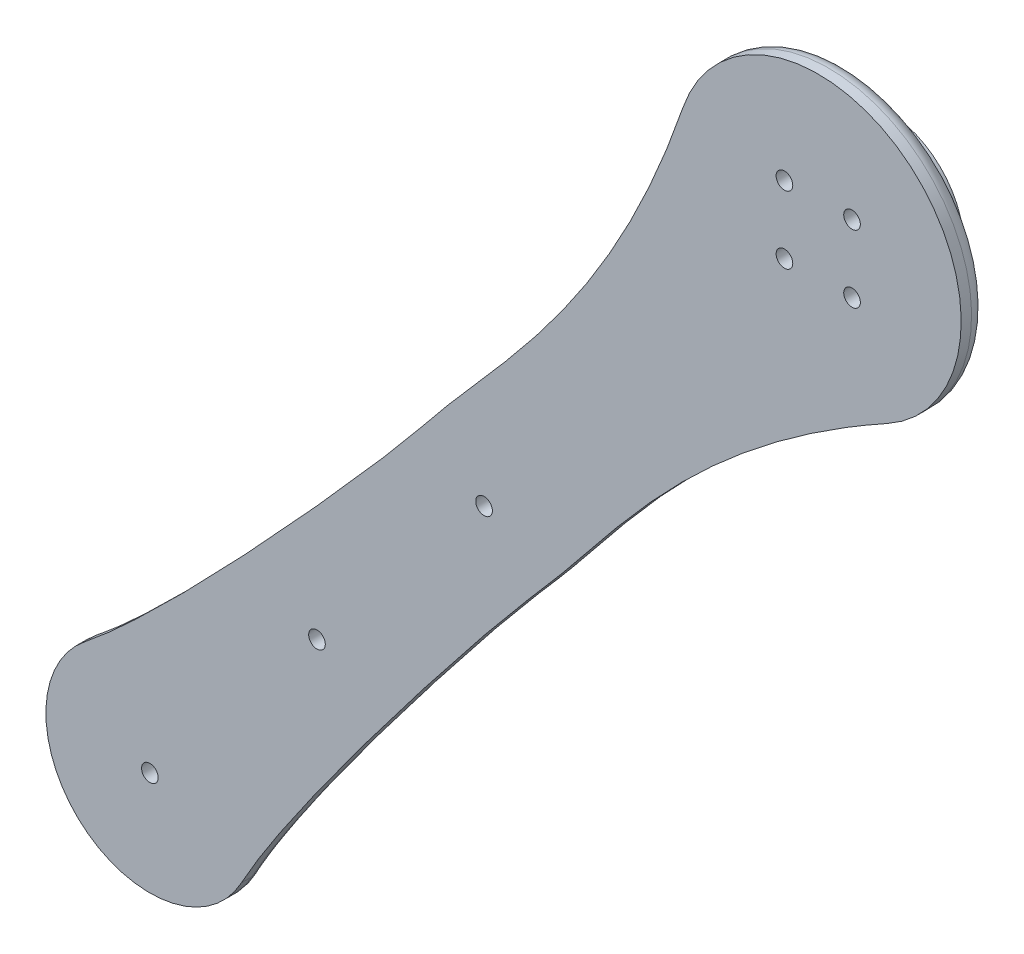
ISO-10303-21;
HEADER;
FILE_DESCRIPTION(('STEP AP214'),'2;1');
FILE_NAME('part.step','',(''),(''),'','','');
FILE_SCHEMA(('AUTOMOTIVE_DESIGN { 1 0 10303 214 1 1 1 1 }'));
ENDSEC;
DATA;
#1=APPLICATION_CONTEXT('core data for automotive mechanical design processes');
#2=APPLICATION_PROTOCOL_DEFINITION('international standard','automotive_design',2000,#1);
#3=PRODUCT_CONTEXT('',#1,'mechanical');
#4=PRODUCT('Part','Part','',(#3));
#5=PRODUCT_RELATED_PRODUCT_CATEGORY('part','',(#4));
#6=PRODUCT_DEFINITION_FORMATION('','',#4);
#7=PRODUCT_DEFINITION_CONTEXT('part definition',#1,'design');
#8=PRODUCT_DEFINITION('design','',#6,#7);
#9=PRODUCT_DEFINITION_SHAPE('','',#8);
#10=(LENGTH_UNIT() NAMED_UNIT(*) SI_UNIT(.MILLI.,.METRE.));
#11=(NAMED_UNIT(*) PLANE_ANGLE_UNIT() SI_UNIT($,.RADIAN.));
#12=(NAMED_UNIT(*) SI_UNIT($,.STERADIAN.) SOLID_ANGLE_UNIT());
#13=UNCERTAINTY_MEASURE_WITH_UNIT(LENGTH_MEASURE(1.E-05),#10,'distance_accuracy_value','');
#14=(GEOMETRIC_REPRESENTATION_CONTEXT(3) GLOBAL_UNCERTAINTY_ASSIGNED_CONTEXT((#13)) GLOBAL_UNIT_ASSIGNED_CONTEXT((#10,
#11,#12)) REPRESENTATION_CONTEXT('',''));
#15=CARTESIAN_POINT('',(0.,0.,0.));
#16=DIRECTION('',(0.,0.,1.));
#17=DIRECTION('',(1.,0.,0.));
#18=AXIS2_PLACEMENT_3D('',#15,#16,#17);
#19=CARTESIAN_POINT('',(148.218221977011,-112.41570779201,10.));
#20=DIRECTION('',(0.,0.,1.));
#21=DIRECTION('',(1.,0.,0.));
#22=AXIS2_PLACEMENT_3D('',#19,#20,#21);
#23=CYLINDRICAL_SURFACE('',#22,1.59999999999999);
#24=CARTESIAN_POINT('',(148.218221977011,-112.41570779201,11.));
#25=DIRECTION('',(0.,0.,-1.));
#26=DIRECTION('',(-1.,0.,0.));
#27=AXIS2_PLACEMENT_3D('',#24,#25,#26);
#28=CIRCLE('',#27,1.59999999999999);
#29=CARTESIAN_POINT('',(146.618221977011,-112.41570779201,11.));
#30=VERTEX_POINT('',#29);
#31=EDGE_CURVE('E103',#30,#30,#28,.F.);
#32=ORIENTED_EDGE('',*,*,#31,.T.);
#33=EDGE_LOOP('',(#32));
#34=FACE_BOUND('',#33,.T.);
#35=CARTESIAN_POINT('',(148.218221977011,-112.41570779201,6.));
#36=DIRECTION('',(0.,0.,-1.));
#37=DIRECTION('',(-1.,0.,0.));
#38=AXIS2_PLACEMENT_3D('',#35,#36,#37);
#39=CIRCLE('',#38,1.59999999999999);
#40=CARTESIAN_POINT('',(146.618221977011,-112.41570779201,6.));
#41=VERTEX_POINT('',#40);
#42=EDGE_CURVE('E79',#41,#41,#39,.F.);
#43=ORIENTED_EDGE('',*,*,#42,.F.);
#44=EDGE_LOOP('',(#43));
#45=FACE_BOUND('',#44,.T.);
#46=ADVANCED_FACE('F75',(#34,#45),#23,.F.);
#47=CARTESIAN_POINT('',(135.218221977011,-112.41570779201,10.));
#48=DIRECTION('',(0.,0.,1.));
#49=DIRECTION('',(1.,0.,0.));
#50=AXIS2_PLACEMENT_3D('',#47,#48,#49);
#51=CYLINDRICAL_SURFACE('',#50,1.59999999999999);
#52=CARTESIAN_POINT('',(135.218221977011,-112.41570779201,11.));
#53=DIRECTION('',(0.,0.,-1.));
#54=DIRECTION('',(-1.,0.,0.));
#55=AXIS2_PLACEMENT_3D('',#52,#53,#54);
#56=CIRCLE('',#55,1.59999999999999);
#57=CARTESIAN_POINT('',(133.618221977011,-112.41570779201,11.));
#58=VERTEX_POINT('',#57);
#59=EDGE_CURVE('E100',#58,#58,#56,.F.);
#60=ORIENTED_EDGE('',*,*,#59,.T.);
#61=EDGE_LOOP('',(#60));
#62=FACE_BOUND('',#61,.T.);
#63=CARTESIAN_POINT('',(135.218221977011,-112.41570779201,6.));
#64=DIRECTION('',(0.,0.,-1.));
#65=DIRECTION('',(-1.,0.,0.));
#66=AXIS2_PLACEMENT_3D('',#63,#64,#65);
#67=CIRCLE('',#66,1.59999999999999);
#68=CARTESIAN_POINT('',(133.618221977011,-112.41570779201,6.));
#69=VERTEX_POINT('',#68);
#70=EDGE_CURVE('E114',#69,#69,#67,.F.);
#71=ORIENTED_EDGE('',*,*,#70,.F.);
#72=EDGE_LOOP('',(#71));
#73=FACE_BOUND('',#72,.T.);
#74=ADVANCED_FACE('F142',(#62,#73),#51,.F.);
#75=CARTESIAN_POINT('',(135.218221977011,-125.41570779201,10.));
#76=DIRECTION('',(0.,0.,1.));
#77=DIRECTION('',(1.,0.,0.));
#78=AXIS2_PLACEMENT_3D('',#75,#76,#77);
#79=CYLINDRICAL_SURFACE('',#78,1.59999999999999);
#80=CARTESIAN_POINT('',(135.218221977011,-125.41570779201,11.));
#81=DIRECTION('',(0.,0.,-1.));
#82=DIRECTION('',(-1.,0.,0.));
#83=AXIS2_PLACEMENT_3D('',#80,#81,#82);
#84=CIRCLE('',#83,1.59999999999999);
#85=CARTESIAN_POINT('',(133.618221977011,-125.41570779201,11.));
#86=VERTEX_POINT('',#85);
#87=EDGE_CURVE('E97',#86,#86,#84,.F.);
#88=ORIENTED_EDGE('',*,*,#87,.T.);
#89=EDGE_LOOP('',(#88));
#90=FACE_BOUND('',#89,.T.);
#91=CARTESIAN_POINT('',(135.218221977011,-125.41570779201,6.));
#92=DIRECTION('',(0.,0.,-1.));
#93=DIRECTION('',(-1.,0.,0.));
#94=AXIS2_PLACEMENT_3D('',#91,#92,#93);
#95=CIRCLE('',#94,1.59999999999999);
#96=CARTESIAN_POINT('',(133.618221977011,-125.41570779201,6.));
#97=VERTEX_POINT('',#96);
#98=EDGE_CURVE('E111',#97,#97,#95,.F.);
#99=ORIENTED_EDGE('',*,*,#98,.F.);
#100=EDGE_LOOP('',(#99));
#101=FACE_BOUND('',#100,.T.);
#102=ADVANCED_FACE('F148',(#90,#101),#79,.F.);
#103=CARTESIAN_POINT('',(148.218221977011,-125.41570779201,10.));
#104=DIRECTION('',(0.,0.,1.));
#105=DIRECTION('',(1.,0.,0.));
#106=AXIS2_PLACEMENT_3D('',#103,#104,#105);
#107=CYLINDRICAL_SURFACE('',#106,1.59999999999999);
#108=CARTESIAN_POINT('',(148.218221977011,-125.41570779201,11.));
#109=DIRECTION('',(0.,0.,-1.));
#110=DIRECTION('',(-1.,0.,0.));
#111=AXIS2_PLACEMENT_3D('',#108,#109,#110);
#112=CIRCLE('',#111,1.59999999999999);
#113=CARTESIAN_POINT('',(146.618221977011,-125.41570779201,11.));
#114=VERTEX_POINT('',#113);
#115=EDGE_CURVE('E94',#114,#114,#112,.F.);
#116=ORIENTED_EDGE('',*,*,#115,.T.);
#117=EDGE_LOOP('',(#116));
#118=FACE_BOUND('',#117,.T.);
#119=CARTESIAN_POINT('',(148.218221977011,-125.41570779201,6.));
#120=DIRECTION('',(0.,0.,-1.));
#121=DIRECTION('',(-1.,0.,0.));
#122=AXIS2_PLACEMENT_3D('',#119,#120,#121);
#123=CIRCLE('',#122,1.59999999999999);
#124=CARTESIAN_POINT('',(146.618221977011,-125.41570779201,6.));
#125=VERTEX_POINT('',#124);
#126=EDGE_CURVE('E108',#125,#125,#123,.F.);
#127=ORIENTED_EDGE('',*,*,#126,.F.);
#128=EDGE_LOOP('',(#127));
#129=FACE_BOUND('',#128,.T.);
#130=ADVANCED_FACE('F158',(#118,#129),#107,.F.);
#131=CARTESIAN_POINT('',(141.718221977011,-118.91570779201,10.));
#132=DIRECTION('',(0.,0.,1.));
#133=DIRECTION('',(1.,0.,0.));
#134=AXIS2_PLACEMENT_3D('',#131,#132,#133);
#135=CYLINDRICAL_SURFACE('',#134,16.);
#136=CARTESIAN_POINT('',(141.718221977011,-118.91570779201,10.));
#137=DIRECTION('',(0.,0.,-1.));
#138=DIRECTION('',(-1.,0.,0.));
#139=AXIS2_PLACEMENT_3D('',#136,#137,#138);
#140=CIRCLE('',#139,16.);
#141=CARTESIAN_POINT('',(125.718221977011,-118.91570779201,10.));
#142=VERTEX_POINT('',#141);
#143=EDGE_CURVE('E83',#142,#142,#140,.T.);
#144=ORIENTED_EDGE('',*,*,#143,.F.);
#145=EDGE_LOOP('',(#144));
#146=FACE_BOUND('',#145,.T.);
#147=CARTESIAN_POINT('',(141.718221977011,-118.91570779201,11.));
#148=DIRECTION('',(0.,0.,-1.));
#149=DIRECTION('',(-1.,0.,0.));
#150=AXIS2_PLACEMENT_3D('',#147,#148,#149);
#151=CIRCLE('',#150,16.);
#152=CARTESIAN_POINT('',(125.718221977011,-118.91570779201,11.));
#153=VERTEX_POINT('',#152);
#154=EDGE_CURVE('E88',#153,#153,#151,.T.);
#155=ORIENTED_EDGE('',*,*,#154,.T.);
#156=EDGE_LOOP('',(#155));
#157=FACE_BOUND('',#156,.T.);
#158=ADVANCED_FACE('F77',(#146,#157),#135,.T.);
#159=CARTESIAN_POINT('',(141.718221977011,-118.91570779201,10.));
#160=DIRECTION('',(0.,0.,-1.));
#161=DIRECTION('',(-1.,0.,0.));
#162=AXIS2_PLACEMENT_3D('',#159,#160,#161);
#163=PLANE('',#162);
#164=CARTESIAN_POINT('',(141.718221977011,-118.91570779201,10.));
#165=DIRECTION('',(0.,0.,-1.));
#166=DIRECTION('',(-1.,0.,0.));
#167=AXIS2_PLACEMENT_3D('',#164,#165,#166);
#168=CIRCLE('',#167,15.0000000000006);
#169=CARTESIAN_POINT('',(126.71822197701,-118.91570779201,10.));
#170=VERTEX_POINT('',#169);
#171=EDGE_CURVE('E12',#170,#170,#168,.T.);
#172=ORIENTED_EDGE('',*,*,#171,.F.);
#173=EDGE_LOOP('',(#172));
#174=FACE_BOUND('',#173,.T.);
#175=ORIENTED_EDGE('',*,*,#143,.T.);
#176=EDGE_LOOP('',(#175));
#177=FACE_BOUND('',#176,.T.);
#178=ADVANCED_FACE('F139',(#174,#177),#163,.T.);
#179=CARTESIAN_POINT('',(141.718221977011,-118.91570779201,11.));
#180=DIRECTION('',(0.,0.,-1.));
#181=DIRECTION('',(-1.,0.,0.));
#182=AXIS2_PLACEMENT_3D('',#179,#180,#181);
#183=PLANE('',#182);
#184=ORIENTED_EDGE('',*,*,#115,.F.);
#185=EDGE_LOOP('',(#184));
#186=FACE_BOUND('',#185,.T.);
#187=ORIENTED_EDGE('',*,*,#87,.F.);
#188=EDGE_LOOP('',(#187));
#189=FACE_BOUND('',#188,.T.);
#190=ORIENTED_EDGE('',*,*,#59,.F.);
#191=EDGE_LOOP('',(#190));
#192=FACE_BOUND('',#191,.T.);
#193=ORIENTED_EDGE('',*,*,#31,.F.);
#194=EDGE_LOOP('',(#193));
#195=FACE_BOUND('',#194,.T.);
#196=ORIENTED_EDGE('',*,*,#154,.F.);
#197=EDGE_LOOP('',(#196));
#198=FACE_BOUND('',#197,.T.);
#199=ADVANCED_FACE('F128',(#186,#189,#192,#195,#198),#183,.F.);
#200=CARTESIAN_POINT('',(141.718221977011,-118.91570779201,3.));
#201=DIRECTION('',(0.,0.,1.));
#202=DIRECTION('',(1.,0.,0.));
#203=AXIS2_PLACEMENT_3D('',#200,#201,#202);
#204=CYLINDRICAL_SURFACE('',#203,15.0000000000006);
#205=CARTESIAN_POINT('',(141.718221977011,-118.91570779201,3.));
#206=DIRECTION('',(0.,0.,-1.));
#207=DIRECTION('',(-1.,0.,0.));
#208=AXIS2_PLACEMENT_3D('',#205,#206,#207);
#209=CIRCLE('',#208,15.0000000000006);
#210=CARTESIAN_POINT('',(126.71822197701,-118.91570779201,3.));
#211=VERTEX_POINT('',#210);
#212=EDGE_CURVE('E92',#211,#211,#209,.T.);
#213=ORIENTED_EDGE('',*,*,#212,.F.);
#214=EDGE_LOOP('',(#213));
#215=FACE_BOUND('',#214,.T.);
#216=ORIENTED_EDGE('',*,*,#171,.T.);
#217=EDGE_LOOP('',(#216));
#218=FACE_BOUND('',#217,.T.);
#219=ADVANCED_FACE('F126',(#215,#218),#204,.T.);
#220=CARTESIAN_POINT('',(0.,0.,3.));
#221=DIRECTION('',(0.,0.,-1.));
#222=DIRECTION('',(-1.,0.,0.));
#223=AXIS2_PLACEMENT_3D('',#220,#221,#222);
#224=PLANE('',#223);
#225=CARTESIAN_POINT('',(148.218221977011,-125.41570779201,3.));
#226=DIRECTION('',(0.,0.,-1.));
#227=DIRECTION('',(-1.,0.,0.));
#228=AXIS2_PLACEMENT_3D('',#225,#226,#227);
#229=CIRCLE('',#228,2.99999999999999);
#230=CARTESIAN_POINT('',(145.218221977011,-125.41570779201,3.));
#231=VERTEX_POINT('',#230);
#232=EDGE_CURVE('E223',#231,#231,#229,.T.);
#233=ORIENTED_EDGE('',*,*,#232,.F.);
#234=EDGE_LOOP('',(#233));
#235=FACE_BOUND('',#234,.T.);
#236=CARTESIAN_POINT('',(135.218221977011,-125.41570779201,3.));
#237=DIRECTION('',(0.,0.,-1.));
#238=DIRECTION('',(-1.,0.,0.));
#239=AXIS2_PLACEMENT_3D('',#236,#237,#238);
#240=CIRCLE('',#239,2.99999999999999);
#241=CARTESIAN_POINT('',(132.218221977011,-125.41570779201,3.));
#242=VERTEX_POINT('',#241);
#243=EDGE_CURVE('E229',#242,#242,#240,.T.);
#244=ORIENTED_EDGE('',*,*,#243,.F.);
#245=EDGE_LOOP('',(#244));
#246=FACE_BOUND('',#245,.T.);
#247=CARTESIAN_POINT('',(135.218221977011,-112.41570779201,3.));
#248=DIRECTION('',(0.,0.,-1.));
#249=DIRECTION('',(-1.,0.,0.));
#250=AXIS2_PLACEMENT_3D('',#247,#248,#249);
#251=CIRCLE('',#250,2.99999999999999);
#252=CARTESIAN_POINT('',(132.218221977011,-112.41570779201,3.));
#253=VERTEX_POINT('',#252);
#254=EDGE_CURVE('E215',#253,#253,#251,.T.);
#255=ORIENTED_EDGE('',*,*,#254,.F.);
#256=EDGE_LOOP('',(#255));
#257=FACE_BOUND('',#256,.T.);
#258=CARTESIAN_POINT('',(148.218221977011,-112.41570779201,3.));
#259=DIRECTION('',(0.,0.,-1.));
#260=DIRECTION('',(-1.,0.,0.));
#261=AXIS2_PLACEMENT_3D('',#258,#259,#260);
#262=CIRCLE('',#261,2.99999999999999);
#263=CARTESIAN_POINT('',(145.218221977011,-112.41570779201,3.));
#264=VERTEX_POINT('',#263);
#265=EDGE_CURVE('E213',#264,#264,#262,.T.);
#266=ORIENTED_EDGE('',*,*,#265,.F.);
#267=EDGE_LOOP('',(#266));
#268=FACE_BOUND('',#267,.T.);
#269=ORIENTED_EDGE('',*,*,#212,.T.);
#270=EDGE_LOOP('',(#269));
#271=FACE_BOUND('',#270,.T.);
#272=ADVANCED_FACE('F124',(#235,#246,#257,#268,#271),#224,.T.);
#273=CARTESIAN_POINT('',(148.218221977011,-112.41570779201,6.));
#274=DIRECTION('',(0.,0.,-1.));
#275=DIRECTION('',(-1.,0.,0.));
#276=AXIS2_PLACEMENT_3D('',#273,#274,#275);
#277=PLANE('',#276);
#278=CARTESIAN_POINT('',(148.218221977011,-112.41570779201,6.));
#279=DIRECTION('',(0.,0.,-1.));
#280=DIRECTION('',(-1.,0.,0.));
#281=AXIS2_PLACEMENT_3D('',#278,#279,#280);
#282=CIRCLE('',#281,2.99999999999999);
#283=CARTESIAN_POINT('',(145.218221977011,-112.41570779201,6.));
#284=VERTEX_POINT('',#283);
#285=EDGE_CURVE('E112',#284,#284,#282,.T.);
#286=ORIENTED_EDGE('',*,*,#285,.T.);
#287=EDGE_LOOP('',(#286));
#288=FACE_BOUND('',#287,.T.);
#289=ORIENTED_EDGE('',*,*,#42,.T.);
#290=EDGE_LOOP('',(#289));
#291=FACE_BOUND('',#290,.T.);
#292=ADVANCED_FACE('F135',(#288,#291),#277,.T.);
#293=CARTESIAN_POINT('',(148.218221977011,-112.41570779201,6.));
#294=DIRECTION('',(0.,0.,-1.));
#295=DIRECTION('',(-1.,0.,0.));
#296=AXIS2_PLACEMENT_3D('',#293,#294,#295);
#297=CYLINDRICAL_SURFACE('',#296,2.99999999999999);
#298=ORIENTED_EDGE('',*,*,#285,.F.);
#299=EDGE_LOOP('',(#298));
#300=FACE_BOUND('',#299,.T.);
#301=ORIENTED_EDGE('',*,*,#265,.T.);
#302=EDGE_LOOP('',(#301));
#303=FACE_BOUND('',#302,.T.);
#304=ADVANCED_FACE('F197',(#300,#303),#297,.F.);
#305=CARTESIAN_POINT('',(135.218221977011,-112.41570779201,6.));
#306=DIRECTION('',(0.,0.,-1.));
#307=DIRECTION('',(-1.,0.,0.));
#308=AXIS2_PLACEMENT_3D('',#305,#306,#307);
#309=PLANE('',#308);
#310=CARTESIAN_POINT('',(135.218221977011,-112.41570779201,6.));
#311=DIRECTION('',(0.,0.,-1.));
#312=DIRECTION('',(-1.,0.,0.));
#313=AXIS2_PLACEMENT_3D('',#310,#311,#312);
#314=CIRCLE('',#313,2.99999999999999);
#315=CARTESIAN_POINT('',(132.218221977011,-112.41570779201,6.));
#316=VERTEX_POINT('',#315);
#317=EDGE_CURVE('E218',#316,#316,#314,.T.);
#318=ORIENTED_EDGE('',*,*,#317,.T.);
#319=EDGE_LOOP('',(#318));
#320=FACE_BOUND('',#319,.T.);
#321=ORIENTED_EDGE('',*,*,#70,.T.);
#322=EDGE_LOOP('',(#321));
#323=FACE_BOUND('',#322,.T.);
#324=ADVANCED_FACE('F200',(#320,#323),#309,.T.);
#325=CARTESIAN_POINT('',(135.218221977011,-112.41570779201,6.));
#326=DIRECTION('',(0.,0.,-1.));
#327=DIRECTION('',(-1.,0.,0.));
#328=AXIS2_PLACEMENT_3D('',#325,#326,#327);
#329=CYLINDRICAL_SURFACE('',#328,2.99999999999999);
#330=ORIENTED_EDGE('',*,*,#317,.F.);
#331=EDGE_LOOP('',(#330));
#332=FACE_BOUND('',#331,.T.);
#333=ORIENTED_EDGE('',*,*,#254,.T.);
#334=EDGE_LOOP('',(#333));
#335=FACE_BOUND('',#334,.T.);
#336=ADVANCED_FACE('F205',(#332,#335),#329,.F.);
#337=CARTESIAN_POINT('',(135.218221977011,-125.41570779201,6.));
#338=DIRECTION('',(0.,0.,-1.));
#339=DIRECTION('',(-1.,0.,0.));
#340=AXIS2_PLACEMENT_3D('',#337,#338,#339);
#341=PLANE('',#340);
#342=CARTESIAN_POINT('',(135.218221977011,-125.41570779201,6.));
#343=DIRECTION('',(0.,0.,-1.));
#344=DIRECTION('',(-1.,0.,0.));
#345=AXIS2_PLACEMENT_3D('',#342,#343,#344);
#346=CIRCLE('',#345,2.99999999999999);
#347=CARTESIAN_POINT('',(132.218221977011,-125.41570779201,6.));
#348=VERTEX_POINT('',#347);
#349=EDGE_CURVE('E226',#348,#348,#346,.T.);
#350=ORIENTED_EDGE('',*,*,#349,.T.);
#351=EDGE_LOOP('',(#350));
#352=FACE_BOUND('',#351,.T.);
#353=ORIENTED_EDGE('',*,*,#98,.T.);
#354=EDGE_LOOP('',(#353));
#355=FACE_BOUND('',#354,.T.);
#356=ADVANCED_FACE('F189',(#352,#355),#341,.T.);
#357=CARTESIAN_POINT('',(135.218221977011,-125.41570779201,6.));
#358=DIRECTION('',(0.,0.,-1.));
#359=DIRECTION('',(-1.,0.,0.));
#360=AXIS2_PLACEMENT_3D('',#357,#358,#359);
#361=CYLINDRICAL_SURFACE('',#360,2.99999999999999);
#362=ORIENTED_EDGE('',*,*,#349,.F.);
#363=EDGE_LOOP('',(#362));
#364=FACE_BOUND('',#363,.T.);
#365=ORIENTED_EDGE('',*,*,#243,.T.);
#366=EDGE_LOOP('',(#365));
#367=FACE_BOUND('',#366,.T.);
#368=ADVANCED_FACE('F180',(#364,#367),#361,.F.);
#369=CARTESIAN_POINT('',(148.218221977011,-125.41570779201,6.));
#370=DIRECTION('',(0.,0.,-1.));
#371=DIRECTION('',(-1.,0.,0.));
#372=AXIS2_PLACEMENT_3D('',#369,#370,#371);
#373=PLANE('',#372);
#374=CARTESIAN_POINT('',(148.218221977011,-125.41570779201,6.));
#375=DIRECTION('',(0.,0.,-1.));
#376=DIRECTION('',(-1.,0.,0.));
#377=AXIS2_PLACEMENT_3D('',#374,#375,#376);
#378=CIRCLE('',#377,2.99999999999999);
#379=CARTESIAN_POINT('',(145.218221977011,-125.41570779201,6.));
#380=VERTEX_POINT('',#379);
#381=EDGE_CURVE('E221',#380,#380,#378,.T.);
#382=ORIENTED_EDGE('',*,*,#381,.T.);
#383=EDGE_LOOP('',(#382));
#384=FACE_BOUND('',#383,.T.);
#385=ORIENTED_EDGE('',*,*,#126,.T.);
#386=EDGE_LOOP('',(#385));
#387=FACE_BOUND('',#386,.T.);
#388=ADVANCED_FACE('F177',(#384,#387),#373,.T.);
#389=CARTESIAN_POINT('',(148.218221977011,-125.41570779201,6.));
#390=DIRECTION('',(0.,0.,-1.));
#391=DIRECTION('',(-1.,0.,0.));
#392=AXIS2_PLACEMENT_3D('',#389,#390,#391);
#393=CYLINDRICAL_SURFACE('',#392,2.99999999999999);
#394=ORIENTED_EDGE('',*,*,#381,.F.);
#395=EDGE_LOOP('',(#394));
#396=FACE_BOUND('',#395,.T.);
#397=ORIENTED_EDGE('',*,*,#232,.T.);
#398=EDGE_LOOP('',(#397));
#399=FACE_BOUND('',#398,.T.);
#400=ADVANCED_FACE('F179',(#396,#399),#393,.F.);
#401=CLOSED_SHELL('',(#46,#74,#102,#130,#158,#178,#199,#219,#272,#292,#304,#324,#336,#356,#368,
#388,#400));
#402=MANIFOLD_SOLID_BREP('B2',#401);
#403=CARTESIAN_POINT('',(76.5989589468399,-175.143739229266,16.));
#404=DIRECTION('',(0.,0.,1.));
#405=DIRECTION('',(1.,0.,0.));
#406=AXIS2_PLACEMENT_3D('',#403,#404,#405);
#407=PLANE('',#406);
#408=CARTESIAN_POINT('',(45.3000805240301,-233.822374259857,16.));
#409=DIRECTION('',(0.,0.,1.));
#410=DIRECTION('',(1.,0.,0.));
#411=AXIS2_PLACEMENT_3D('',#408,#409,#410);
#412=CIRCLE('',#411,1.6);
#413=CARTESIAN_POINT('',(46.9000805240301,-233.822374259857,16.));
#414=VERTEX_POINT('',#413);
#415=EDGE_CURVE('E689',#414,#414,#412,.T.);
#416=ORIENTED_EDGE('',*,*,#415,.F.);
#417=EDGE_LOOP('',(#416));
#418=FACE_BOUND('',#417,.T.);
#419=CARTESIAN_POINT('',(135.218221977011,-125.41570779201,16.));
#420=DIRECTION('',(0.,0.,1.));
#421=DIRECTION('',(1.,0.,0.));
#422=AXIS2_PLACEMENT_3D('',#419,#420,#421);
#423=CIRCLE('',#422,1.59999999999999);
#424=CARTESIAN_POINT('',(136.818221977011,-125.41570779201,16.));
#425=VERTEX_POINT('',#424);
#426=EDGE_CURVE('E693',#425,#425,#423,.T.);
#427=ORIENTED_EDGE('',*,*,#426,.F.);
#428=EDGE_LOOP('',(#427));
#429=FACE_BOUND('',#428,.T.);
#430=CARTESIAN_POINT('',(135.218221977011,-112.41570779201,16.));
#431=DIRECTION('',(0.,0.,1.));
#432=DIRECTION('',(1.,0.,0.));
#433=AXIS2_PLACEMENT_3D('',#430,#431,#432);
#434=CIRCLE('',#433,1.59999999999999);
#435=CARTESIAN_POINT('',(136.818221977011,-112.41570779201,16.));
#436=VERTEX_POINT('',#435);
#437=EDGE_CURVE('E696',#436,#436,#434,.T.);
#438=ORIENTED_EDGE('',*,*,#437,.F.);
#439=EDGE_LOOP('',(#438));
#440=FACE_BOUND('',#439,.T.);
#441=CARTESIAN_POINT('',(115.704809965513,-109.996492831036,16.));
#442=CARTESIAN_POINT('',(101.948797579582,-150.116707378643,16.));
#443=CARTESIAN_POINT('',(78.1787907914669,-171.772825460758,16.));
#444=CARTESIAN_POINT('',(58.7170794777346,-197.082387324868,16.));
#445=CARTESIAN_POINT('',(16.3569995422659,-244.049515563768,16.));
#446=CARTESIAN_POINT('',(0.724486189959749,-256.461244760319,16.));
#447=B_SPLINE_CURVE_WITH_KNOTS('',3,(#441,#442,#443,#444,#445,#446),.UNSPECIFIED.,.F.,.F.,(4,1,
1,4),(0.,0.619090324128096,0.719090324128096,1.),.UNSPECIFIED.);
#448=CARTESIAN_POINT('',(115.704809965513,-109.996492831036,16.));
#449=VERTEX_POINT('',#448);
#450=CARTESIAN_POINT('',(0.724486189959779,-256.461244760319,16.));
#451=VERTEX_POINT('',#450);
#452=EDGE_CURVE('E447',#449,#451,#447,.T.);
#453=ORIENTED_EDGE('',*,*,#452,.T.);
#454=CARTESIAN_POINT('',(13.1607000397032,-272.124596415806,16.));
#455=DIRECTION('',(0.,0.,1.));
#456=DIRECTION('',(1.,0.,0.));
#457=AXIS2_PLACEMENT_3D('',#454,#455,#456);
#458=CIRCLE('',#457,20.);
#459=CARTESIAN_POINT('',(30.7456160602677,-281.651963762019,16.));
#460=VERTEX_POINT('',#459);
#461=EDGE_CURVE('E438',#451,#460,#458,.T.);
#462=ORIENTED_EDGE('',*,*,#461,.T.);
#463=CARTESIAN_POINT('',(30.7456160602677,-281.651963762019,16.));
#464=CARTESIAN_POINT('',(40.2542257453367,-264.101669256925,16.));
#465=CARTESIAN_POINT('',(79.1520670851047,-214.229377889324,16.));
#466=CARTESIAN_POINT('',(100.697629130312,-190.668374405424,16.));
#467=CARTESIAN_POINT('',(117.89712375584,-163.498941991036,16.));
#468=CARTESIAN_POINT('',(155.019115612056,-142.985112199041,16.));
#469=B_SPLINE_CURVE_WITH_KNOTS('',3,(#463,#464,#465,#466,#467,#468),.UNSPECIFIED.,.F.,.F.,(4,1,
1,4),(0.,0.280909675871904,0.380909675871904,1.),.UNSPECIFIED.);
#470=CARTESIAN_POINT('',(155.019115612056,-142.985112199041,16.));
#471=VERTEX_POINT('',#470);
#472=EDGE_CURVE('E446',#460,#471,#469,.T.);
#473=ORIENTED_EDGE('',*,*,#472,.T.);
#474=CARTESIAN_POINT('',(141.718221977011,-118.91570779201,16.));
#475=DIRECTION('',(0.,0.,1.));
#476=DIRECTION('',(1.,0.,0.));
#477=AXIS2_PLACEMENT_3D('',#474,#475,#476);
#478=CIRCLE('',#477,27.5);
#479=EDGE_CURVE('E452',#471,#449,#478,.T.);
#480=ORIENTED_EDGE('',*,*,#479,.T.);
#481=EDGE_LOOP('',(#453,#462,#473,#480));
#482=FACE_BOUND('',#481,.T.);
#483=CARTESIAN_POINT('',(148.218221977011,-112.41570779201,16.));
#484=DIRECTION('',(0.,0.,1.));
#485=DIRECTION('',(1.,0.,0.));
#486=AXIS2_PLACEMENT_3D('',#483,#484,#485);
#487=CIRCLE('',#486,1.59999999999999);
#488=CARTESIAN_POINT('',(149.818221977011,-112.41570779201,16.));
#489=VERTEX_POINT('',#488);
#490=EDGE_CURVE('E456',#489,#489,#487,.T.);
#491=ORIENTED_EDGE('',*,*,#490,.F.);
#492=EDGE_LOOP('',(#491));
#493=FACE_BOUND('',#492,.T.);
#494=CARTESIAN_POINT('',(148.218221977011,-125.41570779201,16.));
#495=DIRECTION('',(0.,0.,1.));
#496=DIRECTION('',(1.,0.,0.));
#497=AXIS2_PLACEMENT_3D('',#494,#495,#496);
#498=CIRCLE('',#497,1.59999999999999);
#499=CARTESIAN_POINT('',(149.818221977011,-125.41570779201,16.));
#500=VERTEX_POINT('',#499);
#501=EDGE_CURVE('E702',#500,#500,#498,.T.);
#502=ORIENTED_EDGE('',*,*,#501,.F.);
#503=EDGE_LOOP('',(#502));
#504=FACE_BOUND('',#503,.T.);
#505=CARTESIAN_POINT('',(77.439461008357,-195.520152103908,16.));
#506=DIRECTION('',(0.,0.,1.));
#507=DIRECTION('',(1.,0.,0.));
#508=AXIS2_PLACEMENT_3D('',#505,#506,#507);
#509=CIRCLE('',#508,1.60000000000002);
#510=CARTESIAN_POINT('',(79.039461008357,-195.520152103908,16.));
#511=VERTEX_POINT('',#510);
#512=EDGE_CURVE('E719',#511,#511,#509,.T.);
#513=ORIENTED_EDGE('',*,*,#512,.F.);
#514=EDGE_LOOP('',(#513));
#515=FACE_BOUND('',#514,.T.);
#516=CARTESIAN_POINT('',(13.1607000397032,-272.124596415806,16.));
#517=DIRECTION('',(0.,0.,1.));
#518=DIRECTION('',(1.,0.,0.));
#519=AXIS2_PLACEMENT_3D('',#516,#517,#518);
#520=CIRCLE('',#519,1.6);
#521=CARTESIAN_POINT('',(14.7607000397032,-272.124596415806,16.));
#522=VERTEX_POINT('',#521);
#523=EDGE_CURVE('E722',#522,#522,#520,.T.);
#524=ORIENTED_EDGE('',*,*,#523,.F.);
#525=EDGE_LOOP('',(#524));
#526=FACE_BOUND('',#525,.T.);
#527=ADVANCED_FACE('F380',(#418,#429,#440,#482,#493,#504,#515,#526),#407,.T.);
#528=CARTESIAN_POINT('',(76.5989589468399,-175.143739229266,11.));
#529=DIRECTION('',(0.,0.,1.));
#530=DIRECTION('',(1.,0.,0.));
#531=AXIS2_PLACEMENT_3D('',#528,#529,#530);
#532=PLANE('',#531);
#533=CARTESIAN_POINT('',(13.1607000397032,-272.124596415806,11.));
#534=DIRECTION('',(0.,0.,1.));
#535=DIRECTION('',(1.,0.,0.));
#536=AXIS2_PLACEMENT_3D('',#533,#534,#535);
#537=CIRCLE('',#536,17.);
#538=CARTESIAN_POINT('',(28.107878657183,-280.222858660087,11.));
#539=VERTEX_POINT('',#538);
#540=CARTESIAN_POINT('',(2.58991826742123,-258.810747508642,11.));
#541=VERTEX_POINT('',#540);
#542=EDGE_CURVE('E570',#539,#541,#537,.F.);
#543=ORIENTED_EDGE('',*,*,#542,.T.);
#544=CARTESIAN_POINT('',(118.542636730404,-110.969498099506,11.));
#545=CARTESIAN_POINT('',(112.905809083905,-127.409635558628,11.));
#546=CARTESIAN_POINT('',(106.133472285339,-140.35275992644,11.));
#547=CARTESIAN_POINT('',(92.2433853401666,-161.608858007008,11.));
#548=CARTESIAN_POINT('',(85.1297962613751,-169.923589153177,11.));
#549=CARTESIAN_POINT('',(77.2929055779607,-178.913024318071,11.));
#550=CARTESIAN_POINT('',(75.7783171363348,-180.640553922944,11.));
#551=CARTESIAN_POINT('',(73.608994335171,-183.153036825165,11.));
#552=CARTESIAN_POINT('',(72.9029751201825,-183.977385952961,11.));
#553=CARTESIAN_POINT('',(71.8724257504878,-185.197431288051,11.));
#554=CARTESIAN_POINT('',(71.5336551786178,-185.601365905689,11.));
#555=CARTESIAN_POINT('',(70.8660700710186,-186.404271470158,11.));
#556=CARTESIAN_POINT('',(70.5388406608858,-186.801529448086,11.));
#557=CARTESIAN_POINT('',(68.9057809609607,-188.80182298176,11.));
#558=CARTESIAN_POINT('',(67.5813511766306,-190.476104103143,11.));
#559=CARTESIAN_POINT('',(64.6537458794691,-194.018479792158,11.));
#560=CARTESIAN_POINT('',(63.5216918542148,-195.370215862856,11.));
#561=CARTESIAN_POINT('',(60.790521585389,-198.572069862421,11.));
#562=CARTESIAN_POINT('',(59.1915358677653,-200.421978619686,11.));
#563=CARTESIAN_POINT('',(50.2589573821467,-210.634653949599,11.));
#564=CARTESIAN_POINT('',(40.1121060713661,-221.887775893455,11.));
#565=CARTESIAN_POINT('',(24.9218403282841,-237.816883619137,11.));
#566=CARTESIAN_POINT('',(19.8643080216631,-242.967357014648,11.));
#567=CARTESIAN_POINT('',(10.499393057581,-252.03269432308,11.));
#568=CARTESIAN_POINT('',(6.19724554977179,-255.946641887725,11.));
#569=CARTESIAN_POINT('',(2.58991826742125,-258.810747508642,11.));
#570=(BOUNDED_CURVE() B_SPLINE_CURVE(3,(#544,#545,#546,#547,#548,#549,#550,#551,#552,#553,#554,
#555,#556,#557,#558,#559,#560,#561,#562,#563,#564,#565,#566,#567,#568,#569),.UNSPECIFIED.,.F.,
.F.) B_SPLINE_CURVE_WITH_KNOTS((4,2,2,2,2,2,2,2,2,2,2,2,4),(0.,0.25,0.5,0.5625,0.59375,0.609375,
0.625,0.6875,0.71875,0.75,0.875,0.9375,1.),
.UNSPECIFIED.) CURVE() GEOMETRIC_REPRESENTATION_ITEM() RATIONAL_B_SPLINE_CURVE((1.,1.,1.,1.,1.,
1.,1.,1.,1.,1.,1.,1.,1.,1.,1.,1.,1.,1.,1.,1.,1.,1.,1.,1.,1.,1.)) REPRESENTATION_ITEM(''));
#571=CARTESIAN_POINT('',(118.542636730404,-110.969498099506,11.));
#572=VERTEX_POINT('',#571);
#573=EDGE_CURVE('E569',#541,#572,#570,.F.);
#574=ORIENTED_EDGE('',*,*,#573,.T.);
#575=CARTESIAN_POINT('',(141.718221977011,-118.91570779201,11.));
#576=DIRECTION('',(0.,0.,1.));
#577=DIRECTION('',(1.,0.,0.));
#578=AXIS2_PLACEMENT_3D('',#575,#576,#577);
#579=CIRCLE('',#578,24.5);
#580=CARTESIAN_POINT('',(153.568109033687,-140.359358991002,11.));
#581=VERTEX_POINT('',#580);
#582=EDGE_CURVE('E546',#572,#581,#579,.F.);
#583=ORIENTED_EDGE('',*,*,#582,.T.);
#584=CARTESIAN_POINT('',(28.107878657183,-280.222858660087,11.));
#585=CARTESIAN_POINT('',(30.3020662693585,-276.172988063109,11.));
#586=CARTESIAN_POINT('',(33.4094921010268,-271.256549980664,11.));
#587=CARTESIAN_POINT('',(40.710906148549,-260.459729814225,11.));
#588=CARTESIAN_POINT('',(44.9049010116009,-254.584662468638,11.));
#589=CARTESIAN_POINT('',(57.9542478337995,-236.859110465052,11.));
#590=CARTESIAN_POINT('',(67.2744273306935,-224.912328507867,11.));
#591=CARTESIAN_POINT('',(75.7808231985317,-214.342043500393,11.));
#592=CARTESIAN_POINT('',(77.3249667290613,-212.446116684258,11.));
#593=CARTESIAN_POINT('',(80.0039146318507,-209.200442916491,11.));
#594=CARTESIAN_POINT('',(81.1385356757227,-207.850860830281,11.));
#595=CARTESIAN_POINT('',(84.1187213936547,-204.352605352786,11.));
#596=CARTESIAN_POINT('',(85.5375816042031,-202.757560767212,11.));
#597=CARTESIAN_POINT('',(87.223908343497,-200.80196358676,11.));
#598=CARTESIAN_POINT('',(87.55830828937,-200.410722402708,11.));
#599=CARTESIAN_POINT('',(88.2330909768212,-199.613856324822,11.));
#600=CARTESIAN_POINT('',(88.5720620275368,-199.210089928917,11.));
#601=CARTESIAN_POINT('',(89.594619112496,-197.983338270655,11.));
#602=CARTESIAN_POINT('',(90.2838455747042,-197.144898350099,11.));
#603=CARTESIAN_POINT('',(92.3814592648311,-194.572244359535,11.));
#604=CARTESIAN_POINT('',(93.8197382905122,-192.780683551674,11.));
#605=CARTESIAN_POINT('',(101.311741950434,-183.501853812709,11.));
#606=CARTESIAN_POINT('',(108.264891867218,-175.052498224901,11.));
#607=CARTESIAN_POINT('',(126.786073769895,-157.682350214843,11.));
#608=CARTESIAN_POINT('',(138.356559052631,-148.765350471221,11.));
#609=CARTESIAN_POINT('',(153.568109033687,-140.359358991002,11.));
#610=(BOUNDED_CURVE() B_SPLINE_CURVE(3,(#584,#585,#586,#587,#588,#589,#590,#591,#592,#593,#594,
#595,#596,#597,#598,#599,#600,#601,#602,#603,#604,#605,#606,#607,#608,#609),.UNSPECIFIED.,.F.,
.F.) B_SPLINE_CURVE_WITH_KNOTS((4,2,2,2,2,2,2,2,2,2,2,2,4),(0.,0.0625,0.125,0.25,0.28125,0.3125,
0.375,0.390625,0.40625,0.4375,0.5,0.75,1.),
.UNSPECIFIED.) CURVE() GEOMETRIC_REPRESENTATION_ITEM() RATIONAL_B_SPLINE_CURVE((1.,1.,1.,1.,1.,
1.,1.,1.,1.,1.,1.,1.,1.,1.,1.,1.,1.,1.,1.,1.,1.,1.,1.,1.,1.,1.)) REPRESENTATION_ITEM(''));
#611=EDGE_CURVE('E464',#581,#539,#610,.F.);
#612=ORIENTED_EDGE('',*,*,#611,.T.);
#613=EDGE_LOOP('',(#543,#574,#583,#612));
#614=FACE_BOUND('',#613,.T.);
#615=CARTESIAN_POINT('',(148.218221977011,-112.41570779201,11.));
#616=DIRECTION('',(0.,0.,1.));
#617=DIRECTION('',(1.,0.,0.));
#618=AXIS2_PLACEMENT_3D('',#615,#616,#617);
#619=CIRCLE('',#618,1.59999999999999);
#620=CARTESIAN_POINT('',(149.818221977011,-112.41570779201,11.));
#621=VERTEX_POINT('',#620);
#622=EDGE_CURVE('E516',#621,#621,#619,.T.);
#623=ORIENTED_EDGE('',*,*,#622,.T.);
#624=EDGE_LOOP('',(#623));
#625=FACE_BOUND('',#624,.T.);
#626=CARTESIAN_POINT('',(135.218221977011,-112.41570779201,11.));
#627=DIRECTION('',(0.,0.,1.));
#628=DIRECTION('',(1.,0.,0.));
#629=AXIS2_PLACEMENT_3D('',#626,#627,#628);
#630=CIRCLE('',#629,1.59999999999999);
#631=CARTESIAN_POINT('',(136.818221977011,-112.41570779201,11.));
#632=VERTEX_POINT('',#631);
#633=EDGE_CURVE('E698',#632,#632,#630,.T.);
#634=ORIENTED_EDGE('',*,*,#633,.T.);
#635=EDGE_LOOP('',(#634));
#636=FACE_BOUND('',#635,.T.);
#637=CARTESIAN_POINT('',(148.218221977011,-125.41570779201,11.));
#638=DIRECTION('',(0.,0.,1.));
#639=DIRECTION('',(1.,0.,0.));
#640=AXIS2_PLACEMENT_3D('',#637,#638,#639);
#641=CIRCLE('',#640,1.59999999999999);
#642=CARTESIAN_POINT('',(149.818221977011,-125.41570779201,11.));
#643=VERTEX_POINT('',#642);
#644=EDGE_CURVE('E705',#643,#643,#641,.T.);
#645=ORIENTED_EDGE('',*,*,#644,.T.);
#646=EDGE_LOOP('',(#645));
#647=FACE_BOUND('',#646,.T.);
#648=CARTESIAN_POINT('',(135.218221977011,-125.41570779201,11.));
#649=DIRECTION('',(0.,0.,1.));
#650=DIRECTION('',(1.,0.,0.));
#651=AXIS2_PLACEMENT_3D('',#648,#649,#650);
#652=CIRCLE('',#651,1.59999999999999);
#653=CARTESIAN_POINT('',(136.818221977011,-125.41570779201,11.));
#654=VERTEX_POINT('',#653);
#655=EDGE_CURVE('E734',#654,#654,#652,.T.);
#656=ORIENTED_EDGE('',*,*,#655,.T.);
#657=EDGE_LOOP('',(#656));
#658=FACE_BOUND('',#657,.T.);
#659=CARTESIAN_POINT('',(77.439461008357,-195.520152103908,11.));
#660=DIRECTION('',(0.,0.,1.));
#661=DIRECTION('',(1.,0.,0.));
#662=AXIS2_PLACEMENT_3D('',#659,#660,#661);
#663=CIRCLE('',#662,1.60000000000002);
#664=CARTESIAN_POINT('',(79.039461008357,-195.520152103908,11.));
#665=VERTEX_POINT('',#664);
#666=EDGE_CURVE('E731',#665,#665,#663,.T.);
#667=ORIENTED_EDGE('',*,*,#666,.T.);
#668=EDGE_LOOP('',(#667));
#669=FACE_BOUND('',#668,.T.);
#670=CARTESIAN_POINT('',(45.3000805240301,-233.822374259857,11.));
#671=DIRECTION('',(0.,0.,1.));
#672=DIRECTION('',(1.,0.,0.));
#673=AXIS2_PLACEMENT_3D('',#670,#671,#672);
#674=CIRCLE('',#673,1.6);
#675=CARTESIAN_POINT('',(46.9000805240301,-233.822374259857,11.));
#676=VERTEX_POINT('',#675);
#677=EDGE_CURVE('E724',#676,#676,#674,.T.);
#678=ORIENTED_EDGE('',*,*,#677,.T.);
#679=EDGE_LOOP('',(#678));
#680=FACE_BOUND('',#679,.T.);
#681=CARTESIAN_POINT('',(13.1607000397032,-272.124596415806,11.));
#682=DIRECTION('',(0.,0.,1.));
#683=DIRECTION('',(1.,0.,0.));
#684=AXIS2_PLACEMENT_3D('',#681,#682,#683);
#685=CIRCLE('',#684,1.6);
#686=CARTESIAN_POINT('',(14.7607000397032,-272.124596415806,11.));
#687=VERTEX_POINT('',#686);
#688=EDGE_CURVE('E594',#687,#687,#685,.T.);
#689=ORIENTED_EDGE('',*,*,#688,.T.);
#690=EDGE_LOOP('',(#689));
#691=FACE_BOUND('',#690,.T.);
#692=ADVANCED_FACE('F524',(#614,#625,#636,#647,#658,#669,#680,#691),#532,.F.);
#693=DIRECTION('',(0.,0.,-1.));
#694=VECTOR('',#693,1.);
#695=SURFACE_OF_LINEAR_EXTRUSION('',#447,#694);
#696=DIRECTION('',(0.,0.,-1.));
#697=VECTOR('',#696,1.);
#698=CARTESIAN_POINT('',(115.704809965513,-109.996492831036,16.));
#699=LINE('',#698,#697);
#700=CARTESIAN_POINT('',(115.704809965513,-109.996492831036,14.));
#701=VERTEX_POINT('',#700);
#702=EDGE_CURVE('E471',#449,#701,#699,.T.);
#703=ORIENTED_EDGE('',*,*,#702,.T.);
#704=CARTESIAN_POINT('',(115.704809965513,-109.996492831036,14.));
#705=CARTESIAN_POINT('',(101.948797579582,-150.116707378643,14.));
#706=CARTESIAN_POINT('',(78.1787907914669,-171.772825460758,14.));
#707=CARTESIAN_POINT('',(58.7170794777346,-197.082387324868,14.));
#708=CARTESIAN_POINT('',(16.3569995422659,-244.049515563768,14.));
#709=CARTESIAN_POINT('',(0.724486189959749,-256.461244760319,14.));
#710=B_SPLINE_CURVE_WITH_KNOTS('',3,(#704,#705,#706,#707,#708,#709),.UNSPECIFIED.,.F.,.F.,(4,1,
1,4),(0.,0.619090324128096,0.719090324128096,1.),.UNSPECIFIED.);
#711=CARTESIAN_POINT('',(0.724486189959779,-256.461244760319,14.));
#712=VERTEX_POINT('',#711);
#713=EDGE_CURVE('E461',#701,#712,#710,.T.);
#714=ORIENTED_EDGE('',*,*,#713,.T.);
#715=DIRECTION('',(0.,0.,-1.));
#716=VECTOR('',#715,1.);
#717=CARTESIAN_POINT('',(0.724486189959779,-256.461244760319,16.));
#718=LINE('',#717,#716);
#719=EDGE_CURVE('E442',#451,#712,#718,.T.);
#720=ORIENTED_EDGE('',*,*,#719,.F.);
#721=ORIENTED_EDGE('',*,*,#452,.F.);
#722=EDGE_LOOP('',(#703,#714,#720,#721));
#723=FACE_BOUND('',#722,.T.);
#724=ADVANCED_FACE('F459',(#723),#695,.F.);
#725=CARTESIAN_POINT('',(13.1607000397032,-272.124596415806,16.));
#726=DIRECTION('',(0.,0.,-1.));
#727=DIRECTION('',(-1.,0.,0.));
#728=AXIS2_PLACEMENT_3D('',#725,#726,#727);
#729=CYLINDRICAL_SURFACE('',#728,20.);
#730=ORIENTED_EDGE('',*,*,#719,.T.);
#731=CARTESIAN_POINT('',(13.1607000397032,-272.124596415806,14.));
#732=DIRECTION('',(0.,0.,1.));
#733=DIRECTION('',(1.,0.,0.));
#734=AXIS2_PLACEMENT_3D('',#731,#732,#733);
#735=CIRCLE('',#734,20.);
#736=CARTESIAN_POINT('',(30.7456160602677,-281.651963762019,14.));
#737=VERTEX_POINT('',#736);
#738=EDGE_CURVE('E408',#712,#737,#735,.T.);
#739=ORIENTED_EDGE('',*,*,#738,.T.);
#740=DIRECTION('',(0.,0.,-1.));
#741=VECTOR('',#740,1.);
#742=CARTESIAN_POINT('',(30.7456160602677,-281.651963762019,16.));
#743=LINE('',#742,#741);
#744=EDGE_CURVE('E443',#460,#737,#743,.T.);
#745=ORIENTED_EDGE('',*,*,#744,.F.);
#746=ORIENTED_EDGE('',*,*,#461,.F.);
#747=EDGE_LOOP('',(#730,#739,#745,#746));
#748=FACE_BOUND('',#747,.T.);
#749=ADVANCED_FACE('F440',(#748),#729,.T.);
#750=DIRECTION('',(0.,0.,-1.));
#751=VECTOR('',#750,1.);
#752=SURFACE_OF_LINEAR_EXTRUSION('',#469,#751);
#753=ORIENTED_EDGE('',*,*,#744,.T.);
#754=CARTESIAN_POINT('',(30.7456160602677,-281.651963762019,14.));
#755=CARTESIAN_POINT('',(40.2542257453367,-264.101669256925,14.));
#756=CARTESIAN_POINT('',(79.1520670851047,-214.229377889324,14.));
#757=CARTESIAN_POINT('',(100.697629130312,-190.668374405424,14.));
#758=CARTESIAN_POINT('',(117.89712375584,-163.498941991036,14.));
#759=CARTESIAN_POINT('',(155.019115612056,-142.985112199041,14.));
#760=B_SPLINE_CURVE_WITH_KNOTS('',3,(#754,#755,#756,#757,#758,#759),.UNSPECIFIED.,.F.,.F.,(4,1,
1,4),(0.,0.280909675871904,0.380909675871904,1.),.UNSPECIFIED.);
#761=CARTESIAN_POINT('',(155.019115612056,-142.985112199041,13.9999999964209));
#762=VERTEX_POINT('',#761);
#763=EDGE_CURVE('E73',#737,#762,#760,.T.);
#764=ORIENTED_EDGE('',*,*,#763,.T.);
#765=DIRECTION('',(0.,0.,-1.));
#766=VECTOR('',#765,1.);
#767=CARTESIAN_POINT('',(155.019115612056,-142.985112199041,16.));
#768=LINE('',#767,#766);
#769=EDGE_CURVE('E465',#471,#762,#768,.T.);
#770=ORIENTED_EDGE('',*,*,#769,.F.);
#771=ORIENTED_EDGE('',*,*,#472,.F.);
#772=EDGE_LOOP('',(#753,#764,#770,#771));
#773=FACE_BOUND('',#772,.T.);
#774=ADVANCED_FACE('F493',(#773),#752,.F.);
#775=CARTESIAN_POINT('',(141.718221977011,-118.91570779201,16.));
#776=DIRECTION('',(0.,0.,-1.));
#777=DIRECTION('',(-1.,0.,0.));
#778=AXIS2_PLACEMENT_3D('',#775,#776,#777);
#779=CYLINDRICAL_SURFACE('',#778,27.5);
#780=ORIENTED_EDGE('',*,*,#769,.T.);
#781=CARTESIAN_POINT('',(141.718221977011,-118.91570779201,14.));
#782=DIRECTION('',(0.,0.,1.));
#783=DIRECTION('',(1.,0.,0.));
#784=AXIS2_PLACEMENT_3D('',#781,#782,#783);
#785=CIRCLE('',#784,27.5);
#786=EDGE_CURVE('E394',#762,#701,#785,.T.);
#787=ORIENTED_EDGE('',*,*,#786,.T.);
#788=ORIENTED_EDGE('',*,*,#702,.F.);
#789=ORIENTED_EDGE('',*,*,#479,.F.);
#790=EDGE_LOOP('',(#780,#787,#788,#789));
#791=FACE_BOUND('',#790,.T.);
#792=ADVANCED_FACE('F503',(#791),#779,.T.);
#793=CARTESIAN_POINT('',(148.218221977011,-112.41570779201,16.));
#794=DIRECTION('',(0.,0.,-1.));
#795=DIRECTION('',(-1.,0.,0.));
#796=AXIS2_PLACEMENT_3D('',#793,#794,#795);
#797=CYLINDRICAL_SURFACE('',#796,1.59999999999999);
#798=ORIENTED_EDGE('',*,*,#490,.T.);
#799=EDGE_LOOP('',(#798));
#800=FACE_BOUND('',#799,.T.);
#801=ORIENTED_EDGE('',*,*,#622,.F.);
#802=EDGE_LOOP('',(#801));
#803=FACE_BOUND('',#802,.T.);
#804=ADVANCED_FACE('F710',(#800,#803),#797,.F.);
#805=CARTESIAN_POINT('',(135.218221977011,-112.41570779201,16.));
#806=DIRECTION('',(0.,0.,-1.));
#807=DIRECTION('',(-1.,0.,0.));
#808=AXIS2_PLACEMENT_3D('',#805,#806,#807);
#809=CYLINDRICAL_SURFACE('',#808,1.59999999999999);
#810=ORIENTED_EDGE('',*,*,#437,.T.);
#811=EDGE_LOOP('',(#810));
#812=FACE_BOUND('',#811,.T.);
#813=ORIENTED_EDGE('',*,*,#633,.F.);
#814=EDGE_LOOP('',(#813));
#815=FACE_BOUND('',#814,.T.);
#816=ADVANCED_FACE('F748',(#812,#815),#809,.F.);
#817=CARTESIAN_POINT('',(148.218221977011,-125.41570779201,16.));
#818=DIRECTION('',(0.,0.,-1.));
#819=DIRECTION('',(-1.,0.,0.));
#820=AXIS2_PLACEMENT_3D('',#817,#818,#819);
#821=CYLINDRICAL_SURFACE('',#820,1.59999999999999);
#822=ORIENTED_EDGE('',*,*,#501,.T.);
#823=EDGE_LOOP('',(#822));
#824=FACE_BOUND('',#823,.T.);
#825=ORIENTED_EDGE('',*,*,#644,.F.);
#826=EDGE_LOOP('',(#825));
#827=FACE_BOUND('',#826,.T.);
#828=ADVANCED_FACE('F745',(#824,#827),#821,.F.);
#829=CARTESIAN_POINT('',(135.218221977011,-125.41570779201,16.));
#830=DIRECTION('',(0.,0.,-1.));
#831=DIRECTION('',(-1.,0.,0.));
#832=AXIS2_PLACEMENT_3D('',#829,#830,#831);
#833=CYLINDRICAL_SURFACE('',#832,1.59999999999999);
#834=ORIENTED_EDGE('',*,*,#426,.T.);
#835=EDGE_LOOP('',(#834));
#836=FACE_BOUND('',#835,.T.);
#837=ORIENTED_EDGE('',*,*,#655,.F.);
#838=EDGE_LOOP('',(#837));
#839=FACE_BOUND('',#838,.T.);
#840=ADVANCED_FACE('F747',(#836,#839),#833,.F.);
#841=CARTESIAN_POINT('',(77.439461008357,-195.520152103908,16.));
#842=DIRECTION('',(0.,0.,-1.));
#843=DIRECTION('',(-1.,0.,0.));
#844=AXIS2_PLACEMENT_3D('',#841,#842,#843);
#845=CYLINDRICAL_SURFACE('',#844,1.60000000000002);
#846=ORIENTED_EDGE('',*,*,#512,.T.);
#847=EDGE_LOOP('',(#846));
#848=FACE_BOUND('',#847,.T.);
#849=ORIENTED_EDGE('',*,*,#666,.F.);
#850=EDGE_LOOP('',(#849));
#851=FACE_BOUND('',#850,.T.);
#852=ADVANCED_FACE('F754',(#848,#851),#845,.F.);
#853=CARTESIAN_POINT('',(45.3000805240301,-233.822374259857,16.));
#854=DIRECTION('',(0.,0.,-1.));
#855=DIRECTION('',(-1.,0.,0.));
#856=AXIS2_PLACEMENT_3D('',#853,#854,#855);
#857=CYLINDRICAL_SURFACE('',#856,1.6);
#858=ORIENTED_EDGE('',*,*,#415,.T.);
#859=EDGE_LOOP('',(#858));
#860=FACE_BOUND('',#859,.T.);
#861=ORIENTED_EDGE('',*,*,#677,.F.);
#862=EDGE_LOOP('',(#861));
#863=FACE_BOUND('',#862,.T.);
#864=ADVANCED_FACE('F807',(#860,#863),#857,.F.);
#865=CARTESIAN_POINT('',(13.1607000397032,-272.124596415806,16.));
#866=DIRECTION('',(0.,0.,-1.));
#867=DIRECTION('',(-1.,0.,0.));
#868=AXIS2_PLACEMENT_3D('',#865,#866,#867);
#869=CYLINDRICAL_SURFACE('',#868,1.6);
#870=ORIENTED_EDGE('',*,*,#523,.T.);
#871=EDGE_LOOP('',(#870));
#872=FACE_BOUND('',#871,.T.);
#873=ORIENTED_EDGE('',*,*,#688,.F.);
#874=EDGE_LOOP('',(#873));
#875=FACE_BOUND('',#874,.T.);
#876=ADVANCED_FACE('F781',(#872,#875),#869,.F.);
#877=CARTESIAN_POINT('',(30.7456160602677,-281.651963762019,14.));
#878=CARTESIAN_POINT('',(32.8612003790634,-277.747173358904,14.0000000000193));
#879=CARTESIAN_POINT('',(35.9261130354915,-272.890497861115,14.0000000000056));
#880=CARTESIAN_POINT('',(43.1644806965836,-262.186906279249,13.9999999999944));
#881=CARTESIAN_POINT('',(47.3379357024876,-256.339990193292,14.));
#882=CARTESIAN_POINT('',(60.3359427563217,-238.684175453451,14.));
#883=CARTESIAN_POINT('',(69.6381368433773,-226.760210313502,14.0000000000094));
#884=CARTESIAN_POINT('',(78.1113778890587,-216.231124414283,13.9999999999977));
#885=CARTESIAN_POINT('',(79.6482875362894,-214.344118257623,14.0000000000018));
#886=CARTESIAN_POINT('',(82.3079466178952,-211.121813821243,13.9999999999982));
#887=CARTESIAN_POINT('',(83.4319206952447,-209.784926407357,14.0000000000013));
#888=CARTESIAN_POINT('',(86.3829564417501,-206.320888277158,13.9999999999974));
#889=CARTESIAN_POINT('',(87.7891316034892,-204.740361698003,14.0000000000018));
#890=CARTESIAN_POINT('',(89.5009727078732,-202.755176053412,13.9999999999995));
#891=CARTESIAN_POINT('',(89.8421958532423,-202.355955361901,14.));
#892=CARTESIAN_POINT('',(90.5280718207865,-201.54598897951,14.));
#893=CARTESIAN_POINT('',(90.872025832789,-201.136281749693,14.0000000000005));
#894=CARTESIAN_POINT('',(91.9079511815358,-199.893492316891,13.9999999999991));
#895=CARTESIAN_POINT('',(92.6039858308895,-199.046742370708,14.000000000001));
#896=CARTESIAN_POINT('',(94.716464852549,-196.455856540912,13.9999999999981));
#897=CARTESIAN_POINT('',(96.1572842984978,-194.661084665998,14.));
#898=CARTESIAN_POINT('',(103.63217299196,-185.403451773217,14.));
#899=CARTESIAN_POINT('',(110.47861663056,-177.089270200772,14.));
#900=CARTESIAN_POINT('',(128.676818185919,-160.022030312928,14.));
#901=CARTESIAN_POINT('',(140.028576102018,-151.268971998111,14.0000000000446));
#902=CARTESIAN_POINT('',(155.019115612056,-142.985112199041,14.));
#903=CARTESIAN_POINT('',(30.7456160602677,-281.651963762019,11.));
#904=CARTESIAN_POINT('',(32.8612003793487,-277.747173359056,11.0000000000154));
#905=CARTESIAN_POINT('',(35.9261130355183,-272.890497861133,10.9999999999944));
#906=CARTESIAN_POINT('',(43.1644806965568,-262.186906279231,11.0000000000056));
#907=CARTESIAN_POINT('',(47.3379357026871,-256.339990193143,10.9999999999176));
#908=CARTESIAN_POINT('',(60.3359427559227,-238.68417545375,11.0000000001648));
#909=CARTESIAN_POINT('',(69.6381368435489,-226.76021031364,11.));
#910=CARTESIAN_POINT('',(78.1113778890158,-216.231124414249,11.));
#911=CARTESIAN_POINT('',(79.6482875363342,-214.344118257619,10.9999999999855));
#912=CARTESIAN_POINT('',(82.3079466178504,-211.121813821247,11.0000000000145));
#913=CARTESIAN_POINT('',(83.4319206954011,-209.78492640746,10.9999999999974));
#914=CARTESIAN_POINT('',(86.3829564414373,-206.320888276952,11.0000000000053));
#915=CARTESIAN_POINT('',(87.7891316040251,-204.740361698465,10.9999999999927));
#916=CARTESIAN_POINT('',(89.5009727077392,-202.755176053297,11.0000000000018));
#917=CARTESIAN_POINT('',(89.8421958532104,-202.355955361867,11.0000000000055));
#918=CARTESIAN_POINT('',(90.5280718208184,-201.545988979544,10.9999999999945));
#919=CARTESIAN_POINT('',(90.8720258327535,-201.136281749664,11.0000000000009));
#920=CARTESIAN_POINT('',(91.907951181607,-199.89349231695,10.9999999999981));
#921=CARTESIAN_POINT('',(92.6039858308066,-199.04674237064,11.0000000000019));
#922=CARTESIAN_POINT('',(94.7164648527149,-196.455856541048,10.9999999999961));
#923=CARTESIAN_POINT('',(96.1572842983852,-194.661084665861,10.9999999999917));
#924=CARTESIAN_POINT('',(103.63217299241,-185.403451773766,11.000000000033));
#925=CARTESIAN_POINT('',(110.478616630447,-177.089270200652,11.));
#926=CARTESIAN_POINT('',(128.676818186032,-160.022030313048,11.));
#927=CARTESIAN_POINT('',(140.028576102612,-151.268971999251,10.9999999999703));
#928=CARTESIAN_POINT('',(155.019115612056,-142.985112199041,11.));
#929=CARTESIAN_POINT('',(28.107878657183,-280.222858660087,11.));
#930=CARTESIAN_POINT('',(30.3020662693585,-276.172988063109,11.));
#931=CARTESIAN_POINT('',(33.4094921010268,-271.256549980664,11.));
#932=CARTESIAN_POINT('',(40.710906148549,-260.459729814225,11.));
#933=CARTESIAN_POINT('',(44.9049010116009,-254.584662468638,11.));
#934=CARTESIAN_POINT('',(57.9542478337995,-236.859110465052,11.));
#935=CARTESIAN_POINT('',(67.2744273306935,-224.912328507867,11.));
#936=CARTESIAN_POINT('',(75.7808231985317,-214.342043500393,11.));
#937=CARTESIAN_POINT('',(77.3249667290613,-212.446116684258,11.));
#938=CARTESIAN_POINT('',(80.0039146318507,-209.200442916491,11.));
#939=CARTESIAN_POINT('',(81.1385356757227,-207.850860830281,11.));
#940=CARTESIAN_POINT('',(84.1187213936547,-204.352605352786,11.));
#941=CARTESIAN_POINT('',(85.5375816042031,-202.757560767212,11.));
#942=CARTESIAN_POINT('',(87.223908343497,-200.80196358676,11.));
#943=CARTESIAN_POINT('',(87.55830828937,-200.410722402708,11.));
#944=CARTESIAN_POINT('',(88.2330909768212,-199.613856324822,11.));
#945=CARTESIAN_POINT('',(88.5720620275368,-199.210089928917,11.));
#946=CARTESIAN_POINT('',(89.594619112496,-197.983338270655,11.));
#947=CARTESIAN_POINT('',(90.2838455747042,-197.144898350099,11.));
#948=CARTESIAN_POINT('',(92.3814592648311,-194.572244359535,11.));
#949=CARTESIAN_POINT('',(93.8197382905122,-192.780683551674,11.));
#950=CARTESIAN_POINT('',(101.311741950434,-183.501853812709,11.));
#951=CARTESIAN_POINT('',(108.264891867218,-175.052498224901,11.));
#952=CARTESIAN_POINT('',(126.786073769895,-157.682350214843,11.));
#953=CARTESIAN_POINT('',(138.356559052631,-148.765350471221,11.));
#954=CARTESIAN_POINT('',(153.568109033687,-140.359358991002,11.));
#955=(BOUNDED_SURFACE() B_SPLINE_SURFACE(2,3,((#877,#878,#879,#880,#881,#882,#883,#884,#885,
#886,#887,#888,#889,#890,#891,#892,#893,#894,#895,#896,#897,#898,#899,#900,#901,#902),(#903,
#904,#905,#906,#907,#908,#909,#910,#911,#912,#913,#914,#915,#916,#917,#918,#919,#920,#921,#922,
#923,#924,#925,#926,#927,#928),(#929,#930,#931,#932,#933,#934,#935,#936,#937,#938,#939,#940,
#941,#942,#943,#944,#945,#946,#947,#948,#949,#950,#951,#952,#953,#954)),.UNSPECIFIED.,.F.,.F.,
.F.) B_SPLINE_SURFACE_WITH_KNOTS((3,3),(4,2,2,2,2,2,2,2,2,2,2,2,4),(0.,1.),(0.,0.0625,0.125,
0.25,0.28125,0.3125,0.375,0.390625,0.40625,0.4375,0.5,0.75,1.),
.UNSPECIFIED.) GEOMETRIC_REPRESENTATION_ITEM() RATIONAL_B_SPLINE_SURFACE(((1.,1.,1.,1.,1.,1.,1.,
1.,1.,1.,1.,1.,1.,1.,1.,1.,1.,1.,1.,1.,1.,1.,1.,1.,1.,1.),(0.707106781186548,0.707106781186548,
0.707106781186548,0.707106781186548,0.707106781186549,0.707106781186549,0.707106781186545,
0.707106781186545,0.707106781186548,0.707106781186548,0.707106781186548,0.707106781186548,
0.707106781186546,0.707106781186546,0.707106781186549,0.707106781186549,0.707106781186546,
0.707106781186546,0.707106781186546,0.707106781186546,0.707106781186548,0.707106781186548,
0.707106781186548,0.707106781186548,0.707106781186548,0.707106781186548),(1.,1.,1.,1.,1.,1.,1.,
1.,1.,1.,1.,1.,1.,1.,1.,1.,1.,1.,1.,1.,1.,1.,1.,1.,1.,1.))) REPRESENTATION_ITEM('') SURFACE());
#956=CARTESIAN_POINT('',(30.7456160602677,-281.651963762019,14.));
#957=CARTESIAN_POINT('',(30.7456160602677,-281.651963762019,11.));
#958=CARTESIAN_POINT('',(28.107878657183,-280.222858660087,11.));
#959=(BOUNDED_CURVE() B_SPLINE_CURVE(2,(#956,#957,#958),.UNSPECIFIED.,.F.,
.F.) B_SPLINE_CURVE_WITH_KNOTS((3,3),(0.,1.),
.UNSPECIFIED.) CURVE() GEOMETRIC_REPRESENTATION_ITEM() RATIONAL_B_SPLINE_CURVE((1.,
0.707106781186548,1.)) REPRESENTATION_ITEM(''));
#960=EDGE_CURVE('E588',#539,#737,#959,.F.);
#961=CARTESIAN_POINT('',(153.568109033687,-140.359358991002,11.));
#962=CARTESIAN_POINT('',(155.019115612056,-142.985112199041,11.));
#963=CARTESIAN_POINT('',(155.019115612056,-142.985112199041,14.));
#964=(BOUNDED_CURVE() B_SPLINE_CURVE(2,(#961,#962,#963),.UNSPECIFIED.,.F.,
.F.) B_SPLINE_CURVE_WITH_KNOTS((3,3),(0.,1.),
.UNSPECIFIED.) CURVE() GEOMETRIC_REPRESENTATION_ITEM() RATIONAL_B_SPLINE_CURVE((1.,
0.707106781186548,1.)) REPRESENTATION_ITEM(''));
#965=EDGE_CURVE('E584',#762,#581,#964,.F.);
#966=ORIENTED_EDGE('',*,*,#960,.F.);
#967=ORIENTED_EDGE('',*,*,#611,.F.);
#968=ORIENTED_EDGE('',*,*,#965,.F.);
#969=ORIENTED_EDGE('',*,*,#763,.F.);
#970=EDGE_LOOP('',(#966,#967,#968,#969));
#971=FACE_BOUND('',#970,.T.);
#972=ADVANCED_FACE('F383',(#971),#955,.T.);
#973=CARTESIAN_POINT('',(141.718221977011,-118.91570779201,14.));
#974=DIRECTION('',(0.,0.,1.));
#975=DIRECTION('',(1.,0.,0.));
#976=AXIS2_PLACEMENT_3D('',#973,#974,#975);
#977=TOROIDAL_SURFACE('',#976,24.5,3.);
#978=ORIENTED_EDGE('',*,*,#965,.T.);
#979=ORIENTED_EDGE('',*,*,#582,.F.);
#980=CARTESIAN_POINT('',(115.704809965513,-109.996492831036,14.));
#981=CARTESIAN_POINT('',(115.704809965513,-109.996492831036,11.));
#982=CARTESIAN_POINT('',(118.542636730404,-110.969498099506,11.));
#983=(BOUNDED_CURVE() B_SPLINE_CURVE(2,(#980,#981,#982),.UNSPECIFIED.,.F.,
.F.) B_SPLINE_CURVE_WITH_KNOTS((3,3),(0.,1.),
.UNSPECIFIED.) CURVE() GEOMETRIC_REPRESENTATION_ITEM() RATIONAL_B_SPLINE_CURVE((1.,
0.707106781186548,1.)) REPRESENTATION_ITEM(''));
#984=EDGE_CURVE('E642',#701,#572,#983,.T.);
#985=ORIENTED_EDGE('',*,*,#984,.F.);
#986=ORIENTED_EDGE('',*,*,#786,.F.);
#987=EDGE_LOOP('',(#978,#979,#985,#986));
#988=FACE_BOUND('',#987,.T.);
#989=ADVANCED_FACE('F593',(#988),#977,.T.);
#990=CARTESIAN_POINT('',(13.1607000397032,-272.124596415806,14.));
#991=DIRECTION('',(0.,0.,1.));
#992=DIRECTION('',(1.,0.,0.));
#993=AXIS2_PLACEMENT_3D('',#990,#991,#992);
#994=TOROIDAL_SURFACE('',#993,17.,3.);
#995=ORIENTED_EDGE('',*,*,#960,.T.);
#996=ORIENTED_EDGE('',*,*,#738,.F.);
#997=CARTESIAN_POINT('',(2.58991826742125,-258.810747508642,11.));
#998=CARTESIAN_POINT('',(0.724486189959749,-256.461244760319,11.));
#999=CARTESIAN_POINT('',(0.72448618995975,-256.461244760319,14.));
#1000=(BOUNDED_CURVE() B_SPLINE_CURVE(2,(#997,#998,#999),.UNSPECIFIED.,.F.,
.F.) B_SPLINE_CURVE_WITH_KNOTS((3,3),(0.,1.),
.UNSPECIFIED.) CURVE() GEOMETRIC_REPRESENTATION_ITEM() RATIONAL_B_SPLINE_CURVE((1.,
0.707106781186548,1.)) REPRESENTATION_ITEM(''));
#1001=EDGE_CURVE('E643',#541,#712,#1000,.T.);
#1002=ORIENTED_EDGE('',*,*,#1001,.F.);
#1003=ORIENTED_EDGE('',*,*,#542,.F.);
#1004=EDGE_LOOP('',(#995,#996,#1002,#1003));
#1005=FACE_BOUND('',#1004,.T.);
#1006=ADVANCED_FACE('F608',(#1005),#994,.T.);
#1007=CARTESIAN_POINT('',(115.704809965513,-109.996492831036,14.));
#1008=CARTESIAN_POINT('',(110.149880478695,-126.197769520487,14.));
#1009=CARTESIAN_POINT('',(103.50101286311,-138.89702135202,14.));
#1010=CARTESIAN_POINT('',(89.8531472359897,-159.782446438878,14.));
#1011=CARTESIAN_POINT('',(82.8541492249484,-167.96861969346,14.));
#1012=CARTESIAN_POINT('',(75.0351613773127,-176.937519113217,14.));
#1013=CARTESIAN_POINT('',(73.5178517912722,-178.668108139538,14.0000000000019));
#1014=CARTESIAN_POINT('',(71.3331554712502,-181.198396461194,13.999999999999));
#1015=CARTESIAN_POINT('',(70.6201347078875,-182.030893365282,14.));
#1016=CARTESIAN_POINT('',(69.5761125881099,-183.2668888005,14.));
#1017=CARTESIAN_POINT('',(69.2323567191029,-183.67676229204,14.));
#1018=CARTESIAN_POINT('',(68.5537966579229,-184.492867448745,14.));
#1019=CARTESIAN_POINT('',(68.2198938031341,-184.898230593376,14.));
#1020=CARTESIAN_POINT('',(66.5621256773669,-186.928788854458,14.));
#1021=CARTESIAN_POINT('',(65.249790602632,-188.588056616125,14.));
#1022=CARTESIAN_POINT('',(62.350820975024,-192.095783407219,14.));
#1023=CARTESIAN_POINT('',(61.2294199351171,-193.434829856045,14.));
#1024=CARTESIAN_POINT('',(58.5179144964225,-196.61363003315,14.));
#1025=CARTESIAN_POINT('',(56.9264577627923,-198.45486574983,13.9999999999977));
#1026=CARTESIAN_POINT('',(48.0286952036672,-208.627735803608,14.0000000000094));
#1027=CARTESIAN_POINT('',(37.9011909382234,-219.859183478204,14.));
#1028=CARTESIAN_POINT('',(22.7706879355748,-235.725621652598,14.));
#1029=CARTESIAN_POINT('',(17.7373124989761,-240.850978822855,14.));
#1030=CARTESIAN_POINT('',(8.45326187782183,-249.838038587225,14.));
#1031=CARTESIAN_POINT('',(4.20258669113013,-253.699741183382,14.));
#1032=CARTESIAN_POINT('',(0.72448618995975,-256.461244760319,14.));
#1033=CARTESIAN_POINT('',(115.704809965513,-109.996492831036,11.));
#1034=CARTESIAN_POINT('',(110.149880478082,-126.197769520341,11.0000000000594));
#1035=CARTESIAN_POINT('',(103.501012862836,-138.897021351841,11.0000000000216));
#1036=CARTESIAN_POINT('',(89.8531472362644,-159.782446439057,10.9999999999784));
#1037=CARTESIAN_POINT('',(82.8541492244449,-167.968619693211,10.9999999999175));
#1038=CARTESIAN_POINT('',(75.0351613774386,-176.937519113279,11.0000000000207));
#1039=CARTESIAN_POINT('',(73.5178517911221,-178.668108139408,11.0000000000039));
#1040=CARTESIAN_POINT('',(71.3331554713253,-181.198396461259,10.9999999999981));
#1041=CARTESIAN_POINT('',(70.6201347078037,-182.030893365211,11.));
#1042=CARTESIAN_POINT('',(69.5761125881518,-183.266888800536,11.));
#1043=CARTESIAN_POINT('',(69.2323567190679,-183.67676229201,11.));
#1044=CARTESIAN_POINT('',(68.5537966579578,-184.492867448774,11.));
#1045=CARTESIAN_POINT('',(68.2198938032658,-184.898230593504,10.9999999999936));
#1046=CARTESIAN_POINT('',(66.56212567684,-186.928788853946,11.0000000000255));
#1047=CARTESIAN_POINT('',(65.2497906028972,-188.588056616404,10.9999999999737));
#1048=CARTESIAN_POINT('',(62.3508209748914,-192.095783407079,11.0000000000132));
#1049=CARTESIAN_POINT('',(61.2294199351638,-193.434829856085,11.0000000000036));
#1050=CARTESIAN_POINT('',(58.5179144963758,-196.61363003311,10.9999999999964));
#1051=CARTESIAN_POINT('',(56.9264577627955,-198.454865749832,10.9999999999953));
#1052=CARTESIAN_POINT('',(48.0286952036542,-208.627735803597,11.0000000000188));
#1053=CARTESIAN_POINT('',(37.9011909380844,-219.859183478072,11.0000000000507));
#1054=CARTESIAN_POINT('',(22.7706879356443,-235.725621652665,10.9999999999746));
#1055=CARTESIAN_POINT('',(17.7373124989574,-240.850978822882,10.9999999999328));
#1056=CARTESIAN_POINT('',(8.45326187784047,-249.838038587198,11.0000000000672));
#1057=CARTESIAN_POINT('',(4.20258669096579,-253.699741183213,10.9999999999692));
#1058=CARTESIAN_POINT('',(0.724486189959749,-256.461244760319,11.));
#1059=CARTESIAN_POINT('',(118.542636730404,-110.969498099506,11.));
#1060=CARTESIAN_POINT('',(112.905809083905,-127.409635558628,11.));
#1061=CARTESIAN_POINT('',(106.133472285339,-140.35275992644,11.));
#1062=CARTESIAN_POINT('',(92.2433853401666,-161.608858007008,11.));
#1063=CARTESIAN_POINT('',(85.1297962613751,-169.923589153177,11.));
#1064=CARTESIAN_POINT('',(77.2929055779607,-178.913024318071,11.));
#1065=CARTESIAN_POINT('',(75.7783171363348,-180.640553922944,11.));
#1066=CARTESIAN_POINT('',(73.608994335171,-183.153036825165,11.));
#1067=CARTESIAN_POINT('',(72.9029751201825,-183.977385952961,11.));
#1068=CARTESIAN_POINT('',(71.8724257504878,-185.197431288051,11.));
#1069=CARTESIAN_POINT('',(71.5336551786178,-185.601365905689,11.));
#1070=CARTESIAN_POINT('',(70.8660700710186,-186.404271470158,11.));
#1071=CARTESIAN_POINT('',(70.5388406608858,-186.801529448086,11.));
#1072=CARTESIAN_POINT('',(68.9057809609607,-188.80182298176,11.));
#1073=CARTESIAN_POINT('',(67.5813511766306,-190.476104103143,11.));
#1074=CARTESIAN_POINT('',(64.6537458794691,-194.018479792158,11.));
#1075=CARTESIAN_POINT('',(63.5216918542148,-195.370215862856,11.));
#1076=CARTESIAN_POINT('',(60.790521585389,-198.572069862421,11.));
#1077=CARTESIAN_POINT('',(59.1915358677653,-200.421978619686,11.));
#1078=CARTESIAN_POINT('',(50.2589573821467,-210.634653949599,11.));
#1079=CARTESIAN_POINT('',(40.1121060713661,-221.887775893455,11.));
#1080=CARTESIAN_POINT('',(24.9218403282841,-237.816883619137,11.));
#1081=CARTESIAN_POINT('',(19.8643080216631,-242.967357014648,11.));
#1082=CARTESIAN_POINT('',(10.499393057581,-252.03269432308,11.));
#1083=CARTESIAN_POINT('',(6.19724554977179,-255.946641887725,11.));
#1084=CARTESIAN_POINT('',(2.58991826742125,-258.810747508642,11.));
#1085=(BOUNDED_SURFACE() B_SPLINE_SURFACE(2,3,((#1007,#1008,#1009,#1010,#1011,#1012,#1013,#1014,
#1015,#1016,#1017,#1018,#1019,#1020,#1021,#1022,#1023,#1024,#1025,#1026,#1027,#1028,#1029,#1030,
#1031,#1032),(#1033,#1034,#1035,#1036,#1037,#1038,#1039,#1040,#1041,#1042,#1043,#1044,#1045,
#1046,#1047,#1048,#1049,#1050,#1051,#1052,#1053,#1054,#1055,#1056,#1057,#1058),(#1059,#1060,
#1061,#1062,#1063,#1064,#1065,#1066,#1067,#1068,#1069,#1070,#1071,#1072,#1073,#1074,#1075,#1076,
#1077,#1078,#1079,#1080,#1081,#1082,#1083,#1084)),.UNSPECIFIED.,.F.,.F.,
.F.) B_SPLINE_SURFACE_WITH_KNOTS((3,3),(4,2,2,2,2,2,2,2,2,2,2,2,4),(0.,1.),(0.,0.25,0.5,0.5625,
0.59375,0.609375,0.625,0.6875,0.71875,0.75,0.875,0.9375,1.),
.UNSPECIFIED.) GEOMETRIC_REPRESENTATION_ITEM() RATIONAL_B_SPLINE_SURFACE(((1.,1.,1.,1.,1.,1.,1.,
1.,1.,1.,1.,1.,1.,1.,1.,1.,1.,1.,1.,1.,1.,1.,1.,1.,1.,1.),(0.707106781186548,0.707106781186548,
0.707106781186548,0.707106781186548,0.70710678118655,0.70710678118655,0.707106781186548,
0.707106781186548,0.707106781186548,0.707106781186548,0.707106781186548,0.707106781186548,
0.70710678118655,0.70710678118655,0.707106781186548,0.707106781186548,0.707106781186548,
0.707106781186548,0.707106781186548,0.707106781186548,0.707106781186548,0.707106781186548,
0.707106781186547,0.707106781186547,0.707106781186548,0.707106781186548),(1.,1.,1.,1.,1.,1.,1.,
1.,1.,1.,1.,1.,1.,1.,1.,1.,1.,1.,1.,1.,1.,1.,1.,1.,1.,1.))) REPRESENTATION_ITEM('') SURFACE());
#1086=ORIENTED_EDGE('',*,*,#984,.T.);
#1087=ORIENTED_EDGE('',*,*,#573,.F.);
#1088=ORIENTED_EDGE('',*,*,#1001,.T.);
#1089=ORIENTED_EDGE('',*,*,#713,.F.);
#1090=EDGE_LOOP('',(#1086,#1087,#1088,#1089));
#1091=FACE_BOUND('',#1090,.T.);
#1092=ADVANCED_FACE('F526',(#1091),#1085,.T.);
#1093=CLOSED_SHELL('',(#527,#692,#724,#749,#774,#792,#804,#816,#828,#840,#852,#864,#876,#972,
#989,#1006,#1092));
#1094=MANIFOLD_SOLID_BREP('B7',#1093);
#1095=ADVANCED_BREP_SHAPE_REPRESENTATION('',(#18,#402,#1094),#14);
#1096=SHAPE_DEFINITION_REPRESENTATION(#9,#1095);
ENDSEC;
END-ISO-10303-21;
